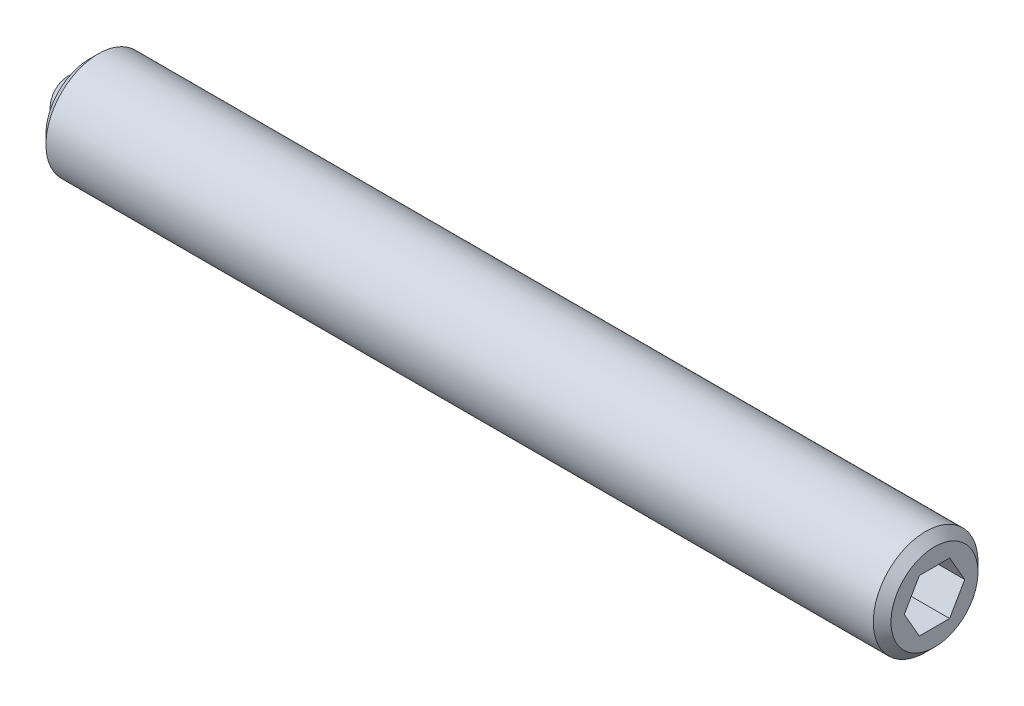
from build123d import *

# Parameters (mm, degrees)
SKETCH2_R           = 1.5
BOSS_EXTRUDE1_DEPTH = 24.2
CHAMFER1_SIZE       = 0.254
CHAMFER2_SIZE       = 0.254
CUT_EXTRUDE2_DEPTH  = 2
SKETCH3_R           = 0.8
CUT_EXTRUDE3_DEPTH  = 0.8
CUT_EXTRUDE4_DEPTH  = 0.8


with BuildPart() as part:
    # Sketch2 → Boss-Extrude1 (new body)
    with BuildSketch(Plane(origin=(0, 0, 0), x_dir=(0, 0, -1), z_dir=(1, 0, 0))):
        Circle(SKETCH2_R)
    extrude(amount=BOSS_EXTRUDE1_DEPTH)

    # Chamfer1
    chamfer1_edges = [part.edges().sort_by_distance(p)[0] for p in [
        (0, 0, 1.5),
    ]]
    chamfer(chamfer1_edges, length=CHAMFER1_SIZE)

    # Chamfer2
    chamfer2_edges = [part.edges().sort_by_distance(p)[0] for p in [
        (24.2, 0, 1.5),
    ]]
    chamfer(chamfer2_edges, length=CHAMFER2_SIZE)

    # Sketch4 → Cut-Extrude2 (cut)
    with BuildSketch(Plane(origin=(24.2, 0, 0), x_dir=(0, 0, -1), z_dir=(1, 0, 0))):
        Polygon((0.866025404, 0), (0.433012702, 0.75), (-0.433012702, 0.75), (-0.866025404, 0), (-0.433012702, -0.75), (0.433012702, -0.75), align=None)
    extrude(amount=-CUT_EXTRUDE2_DEPTH, mode=Mode.SUBTRACT)

    # Sketch3 → Cut-Extrude3 (cut)
    with BuildSketch(Plane.ZY):
        Circle(SKETCH3_R)
    extrude(amount=-CUT_EXTRUDE3_DEPTH, mode=Mode.SUBTRACT)

    # Sketch7 → Cut-Extrude4 (cut)
    with BuildSketch(Plane.ZY):
        with BuildLine():
            ThreePointArc((0.063449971, 0.797479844), (0, 0.8), (-0.063449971, 0.797479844))
            ThreePointArc((-0.063449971, 0.797479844), (0, 0.8635), (0.063449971, 0.797479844))
        make_face()
    extrude(amount=-CUT_EXTRUDE4_DEPTH, mode=Mode.SUBTRACT)


with BuildPart() as body_2:
    # Sketch5 → Revolve1 (revolve)
    with BuildSketch(Plane.ZY):
        with BuildLine():
            Line((0, 0), (0, -0.8))
            ThreePointArc((0, -0.8), (-0.8, 0), (0, 0.8))
            Line((0, 0.8), (0, 0))
        make_face()
    revolve(axis=Axis((0, 0, 0), (0, 1, 0)))


solid = Compound([part.part, body_2.part])
